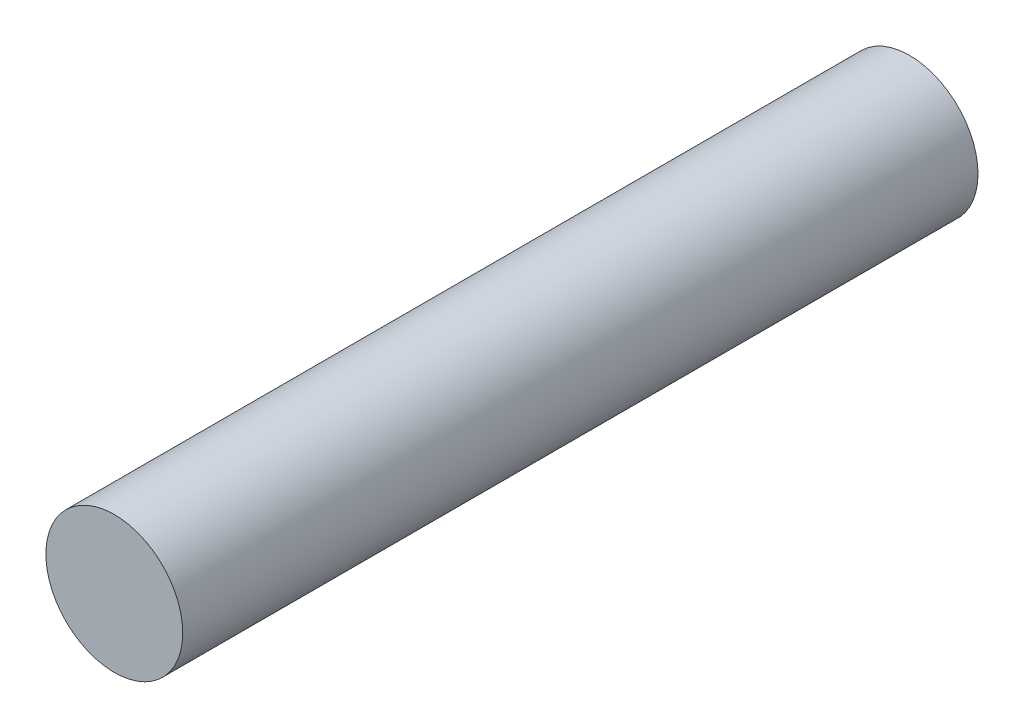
ISO-10303-21;
HEADER;
FILE_DESCRIPTION(('STEP AP214'),'2;1');
FILE_NAME('part.step','',(''),(''),'','','');
FILE_SCHEMA(('AUTOMOTIVE_DESIGN { 1 0 10303 214 1 1 1 1 }'));
ENDSEC;
DATA;
#1=APPLICATION_CONTEXT('core data for automotive mechanical design processes');
#2=APPLICATION_PROTOCOL_DEFINITION('international standard','automotive_design',2000,#1);
#3=PRODUCT_CONTEXT('',#1,'mechanical');
#4=PRODUCT('Part','Part','',(#3));
#5=PRODUCT_RELATED_PRODUCT_CATEGORY('part','',(#4));
#6=PRODUCT_DEFINITION_FORMATION('','',#4);
#7=PRODUCT_DEFINITION_CONTEXT('part definition',#1,'design');
#8=PRODUCT_DEFINITION('design','',#6,#7);
#9=PRODUCT_DEFINITION_SHAPE('','',#8);
#10=(LENGTH_UNIT() NAMED_UNIT(*) SI_UNIT(.MILLI.,.METRE.));
#11=(NAMED_UNIT(*) PLANE_ANGLE_UNIT() SI_UNIT($,.RADIAN.));
#12=(NAMED_UNIT(*) SI_UNIT($,.STERADIAN.) SOLID_ANGLE_UNIT());
#13=UNCERTAINTY_MEASURE_WITH_UNIT(LENGTH_MEASURE(1.E-05),#10,'distance_accuracy_value','');
#14=(GEOMETRIC_REPRESENTATION_CONTEXT(3) GLOBAL_UNCERTAINTY_ASSIGNED_CONTEXT((#13)) GLOBAL_UNIT_ASSIGNED_CONTEXT((#10,
#11,#12)) REPRESENTATION_CONTEXT('',''));
#15=CARTESIAN_POINT('',(0.,0.,0.));
#16=DIRECTION('',(0.,0.,1.));
#17=DIRECTION('',(1.,0.,0.));
#18=AXIS2_PLACEMENT_3D('',#15,#16,#17);
#19=CARTESIAN_POINT('',(23.8506,-39.9542,-23.0251));
#20=DIRECTION('',(0.,0.,1.));
#21=DIRECTION('',(1.,0.,0.));
#22=AXIS2_PLACEMENT_3D('',#19,#20,#21);
#23=PLANE('',#22);
#24=CARTESIAN_POINT('',(23.8506,-39.9542,-23.0251));
#25=DIRECTION('',(0.,0.,1.));
#26=DIRECTION('',(1.,0.,0.));
#27=AXIS2_PLACEMENT_3D('',#24,#25,#26);
#28=CIRCLE('',#27,1.9812);
#29=CARTESIAN_POINT('',(25.8318,-39.9542,-23.0251));
#30=VERTEX_POINT('',#29);
#31=EDGE_CURVE('E17',#30,#30,#28,.T.);
#32=ORIENTED_EDGE('',*,*,#31,.F.);
#33=EDGE_LOOP('',(#32));
#34=FACE_BOUND('',#33,.T.);
#35=ADVANCED_FACE('F14',(#34),#23,.F.);
#36=CARTESIAN_POINT('',(23.8506,-39.9542,0.));
#37=DIRECTION('',(0.,0.,1.));
#38=DIRECTION('',(1.,0.,0.));
#39=AXIS2_PLACEMENT_3D('',#36,#37,#38);
#40=PLANE('',#39);
#41=CARTESIAN_POINT('',(23.8506,-39.9542,0.));
#42=DIRECTION('',(0.,0.,1.));
#43=DIRECTION('',(1.,0.,0.));
#44=AXIS2_PLACEMENT_3D('',#41,#42,#43);
#45=CIRCLE('',#44,1.9812);
#46=CARTESIAN_POINT('',(25.8318,-39.9542,0.));
#47=VERTEX_POINT('',#46);
#48=EDGE_CURVE('E10',#47,#47,#45,.F.);
#49=ORIENTED_EDGE('',*,*,#48,.F.);
#50=EDGE_LOOP('',(#49));
#51=FACE_BOUND('',#50,.T.);
#52=ADVANCED_FACE('F29',(#51),#40,.T.);
#53=CARTESIAN_POINT('',(23.8506,-39.9542,-23.0251));
#54=DIRECTION('',(0.,0.,1.));
#55=DIRECTION('',(1.,0.,0.));
#56=AXIS2_PLACEMENT_3D('',#53,#54,#55);
#57=CYLINDRICAL_SURFACE('',#56,1.9812);
#58=ORIENTED_EDGE('',*,*,#48,.T.);
#59=EDGE_LOOP('',(#58));
#60=FACE_BOUND('',#59,.T.);
#61=ORIENTED_EDGE('',*,*,#31,.T.);
#62=EDGE_LOOP('',(#61));
#63=FACE_BOUND('',#62,.T.);
#64=ADVANCED_FACE('F26',(#60,#63),#57,.T.);
#65=CLOSED_SHELL('',(#35,#52,#64));
#66=MANIFOLD_SOLID_BREP('B1',#65);
#67=ADVANCED_BREP_SHAPE_REPRESENTATION('',(#18,#66),#14);
#68=SHAPE_DEFINITION_REPRESENTATION(#9,#67);
ENDSEC;
END-ISO-10303-21;
